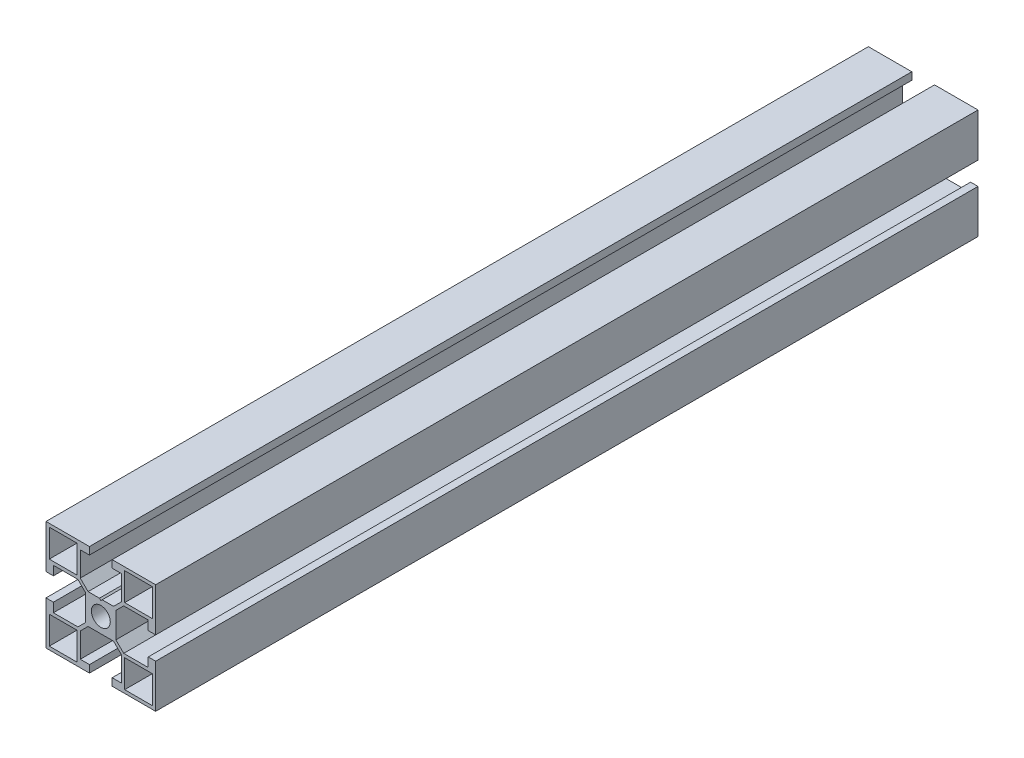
from build123d import *

# Parameters (mm, degrees)
MODEL_R         = 3.45
MODEL_W         = 10.1
MODEL_H         = 10.1
EXTRUDE_1_DEPTH = 300


with BuildPart() as part:
    # Model → Extrude 1 (new body)
    with BuildSketch(Plane.XY):
        Polygon((4827.37622995, 1521.250305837), (4826.87622995, 1520.750305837), (4826.37622995, 1521.250305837), (4822.224758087, 1521.250305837), (4819.37622995, 1524.098833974), (4819.37622995, 1533.050305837), (4822.72622995, 1533.050305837), (4822.72622995, 1535.750305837), (4806.87622995, 1535.750305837), (4806.87622995, 1519.900305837), (4809.57622995, 1519.900305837), (4809.57622995, 1523.250305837), (4818.527701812, 1523.250305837), (4821.37622995, 1520.4017777), (4821.37622995, 1511.098833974), (4818.527701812, 1508.250305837), (4809.57622995, 1508.250305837), (4809.57622995, 1511.600305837), (4806.87622995, 1511.600305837), (4806.87622995, 1495.750305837), (4822.72622995, 1495.750305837), (4822.72622995, 1498.450305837), (4819.37622995, 1498.450305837), (4819.37622995, 1507.4017777), (4822.224758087, 1510.250305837), (4831.527701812, 1510.250305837), (4834.37622995, 1507.4017777), (4834.37622995, 1498.450305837), (4831.02622995, 1498.450305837), (4831.02622995, 1495.750305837), (4846.87622995, 1495.750305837), (4846.87622995, 1511.600305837), (4844.17622995, 1511.600305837), (4844.17622995, 1508.250305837), (4835.224758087, 1508.250305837), (4832.37622995, 1511.098833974), (4832.37622995, 1520.4017777), (4835.224758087, 1523.250305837), (4844.17622995, 1523.250305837), (4844.17622995, 1519.900305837), (4846.87622995, 1519.900305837), (4846.87622995, 1535.750305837), (4831.02622995, 1535.750305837), (4831.02622995, 1533.050305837), (4834.37622995, 1533.050305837), (4834.37622995, 1524.098833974), (4831.527701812, 1521.250305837), align=None)
        with Locations((4826.87622995, 1515.750305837)):
            Circle(MODEL_R, mode=Mode.SUBTRACT)
        with Locations((4840.62622995, 1529.500305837)):
            Rectangle(MODEL_W, MODEL_H, mode=Mode.SUBTRACT)
        with Locations((4813.12622995, 1529.500305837)):
            Rectangle(MODEL_W, MODEL_H, mode=Mode.SUBTRACT)
        with Locations((4813.12622995, 1502.000305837)):
            Rectangle(MODEL_W, MODEL_H, mode=Mode.SUBTRACT)
        with Locations((4840.62622995, 1502.000305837)):
            Rectangle(MODEL_W, MODEL_H, mode=Mode.SUBTRACT)
    extrude(amount=EXTRUDE_1_DEPTH)


solid = part.part
